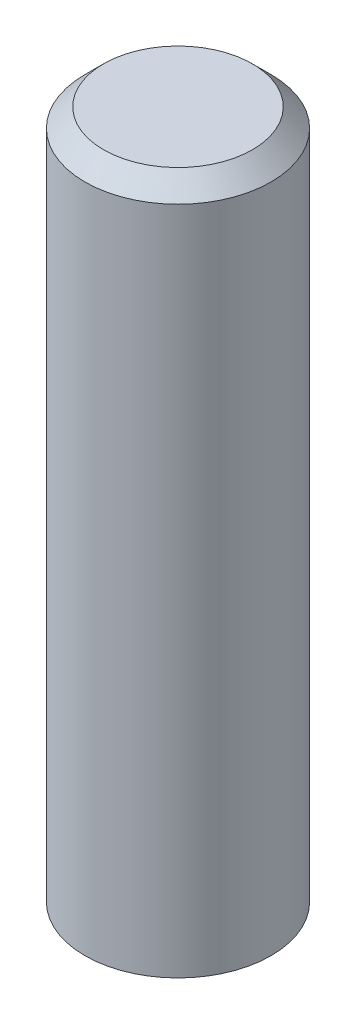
ISO-10303-21;
HEADER;
FILE_DESCRIPTION(('STEP AP214'),'2;1');
FILE_NAME('part.step','',(''),(''),'','','');
FILE_SCHEMA(('AUTOMOTIVE_DESIGN { 1 0 10303 214 1 1 1 1 }'));
ENDSEC;
DATA;
#1=APPLICATION_CONTEXT('core data for automotive mechanical design processes');
#2=APPLICATION_PROTOCOL_DEFINITION('international standard','automotive_design',2000,#1);
#3=PRODUCT_CONTEXT('',#1,'mechanical');
#4=PRODUCT('Part','Part','',(#3));
#5=PRODUCT_RELATED_PRODUCT_CATEGORY('part','',(#4));
#6=PRODUCT_DEFINITION_FORMATION('','',#4);
#7=PRODUCT_DEFINITION_CONTEXT('part definition',#1,'design');
#8=PRODUCT_DEFINITION('design','',#6,#7);
#9=PRODUCT_DEFINITION_SHAPE('','',#8);
#10=(LENGTH_UNIT() NAMED_UNIT(*) SI_UNIT(.MILLI.,.METRE.));
#11=(NAMED_UNIT(*) PLANE_ANGLE_UNIT() SI_UNIT($,.RADIAN.));
#12=(NAMED_UNIT(*) SI_UNIT($,.STERADIAN.) SOLID_ANGLE_UNIT());
#13=UNCERTAINTY_MEASURE_WITH_UNIT(LENGTH_MEASURE(1.E-05),#10,'distance_accuracy_value','');
#14=(GEOMETRIC_REPRESENTATION_CONTEXT(3) GLOBAL_UNCERTAINTY_ASSIGNED_CONTEXT((#13)) GLOBAL_UNIT_ASSIGNED_CONTEXT((#10,
#11,#12)) REPRESENTATION_CONTEXT('',''));
#15=CARTESIAN_POINT('',(0.,0.,0.));
#16=DIRECTION('',(0.,0.,1.));
#17=DIRECTION('',(1.,0.,0.));
#18=AXIS2_PLACEMENT_3D('',#15,#16,#17);
#19=CARTESIAN_POINT('',(0.,0.,0.));
#20=DIRECTION('',(0.,1.,0.));
#21=DIRECTION('',(0.,0.,1.));
#22=AXIS2_PLACEMENT_3D('',#19,#20,#21);
#23=CYLINDRICAL_SURFACE('',#22,5.);
#24=CARTESIAN_POINT('',(0.,0.,0.));
#25=DIRECTION('',(0.,1.,0.));
#26=DIRECTION('',(0.,0.,1.));
#27=AXIS2_PLACEMENT_3D('',#24,#25,#26);
#28=CIRCLE('',#27,5.);
#29=CARTESIAN_POINT('',(0.,0.,5.));
#30=VERTEX_POINT('',#29);
#31=EDGE_CURVE('E10',#30,#30,#28,.T.);
#32=ORIENTED_EDGE('',*,*,#31,.T.);
#33=EDGE_LOOP('',(#32));
#34=FACE_BOUND('',#33,.T.);
#35=CARTESIAN_POINT('',(0.,36.,0.));
#36=DIRECTION('',(0.,1.,0.));
#37=DIRECTION('',(0.,0.,1.));
#38=AXIS2_PLACEMENT_3D('',#35,#36,#37);
#39=CIRCLE('',#38,5.);
#40=CARTESIAN_POINT('',(0.,36.,5.));
#41=VERTEX_POINT('',#40);
#42=EDGE_CURVE('E41',#41,#41,#39,.T.);
#43=ORIENTED_EDGE('',*,*,#42,.F.);
#44=EDGE_LOOP('',(#43));
#45=FACE_BOUND('',#44,.T.);
#46=ADVANCED_FACE('F31',(#34,#45),#23,.T.);
#47=CARTESIAN_POINT('',(5.,0.,0.));
#48=DIRECTION('',(0.,-1.,0.));
#49=DIRECTION('',(0.,0.,-1.));
#50=AXIS2_PLACEMENT_3D('',#47,#48,#49);
#51=PLANE('',#50);
#52=ORIENTED_EDGE('',*,*,#31,.F.);
#53=EDGE_LOOP('',(#52));
#54=FACE_BOUND('',#53,.T.);
#55=ADVANCED_FACE('F52',(#54),#51,.T.);
#56=CARTESIAN_POINT('',(0.,37.,0.));
#57=DIRECTION('',(0.,1.,0.));
#58=DIRECTION('',(0.,0.,1.));
#59=AXIS2_PLACEMENT_3D('',#56,#57,#58);
#60=PLANE('',#59);
#61=CARTESIAN_POINT('',(0.,37.,0.));
#62=DIRECTION('',(0.,1.,0.));
#63=DIRECTION('',(0.,0.,1.));
#64=AXIS2_PLACEMENT_3D('',#61,#62,#63);
#65=CIRCLE('',#64,4.);
#66=CARTESIAN_POINT('',(0.,37.,4.));
#67=VERTEX_POINT('',#66);
#68=EDGE_CURVE('E37',#67,#67,#65,.T.);
#69=ORIENTED_EDGE('',*,*,#68,.T.);
#70=EDGE_LOOP('',(#69));
#71=FACE_BOUND('',#70,.T.);
#72=ADVANCED_FACE('F56',(#71),#60,.T.);
#73=CARTESIAN_POINT('',(0.,37.,0.));
#74=DIRECTION('',(0.,-1.,0.));
#75=DIRECTION('',(0.,0.,-1.));
#76=AXIS2_PLACEMENT_3D('',#73,#74,#75);
#77=CONICAL_SURFACE('',#76,4.,0.78539816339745);
#78=ORIENTED_EDGE('',*,*,#42,.T.);
#79=EDGE_LOOP('',(#78));
#80=FACE_BOUND('',#79,.T.);
#81=ORIENTED_EDGE('',*,*,#68,.F.);
#82=EDGE_LOOP('',(#81));
#83=FACE_BOUND('',#82,.T.);
#84=ADVANCED_FACE('F48',(#80,#83),#77,.T.);
#85=CLOSED_SHELL('',(#46,#55,#72,#84));
#86=MANIFOLD_SOLID_BREP('B2',#85);
#87=ADVANCED_BREP_SHAPE_REPRESENTATION('',(#18,#86),#14);
#88=SHAPE_DEFINITION_REPRESENTATION(#9,#87);
ENDSEC;
END-ISO-10303-21;
